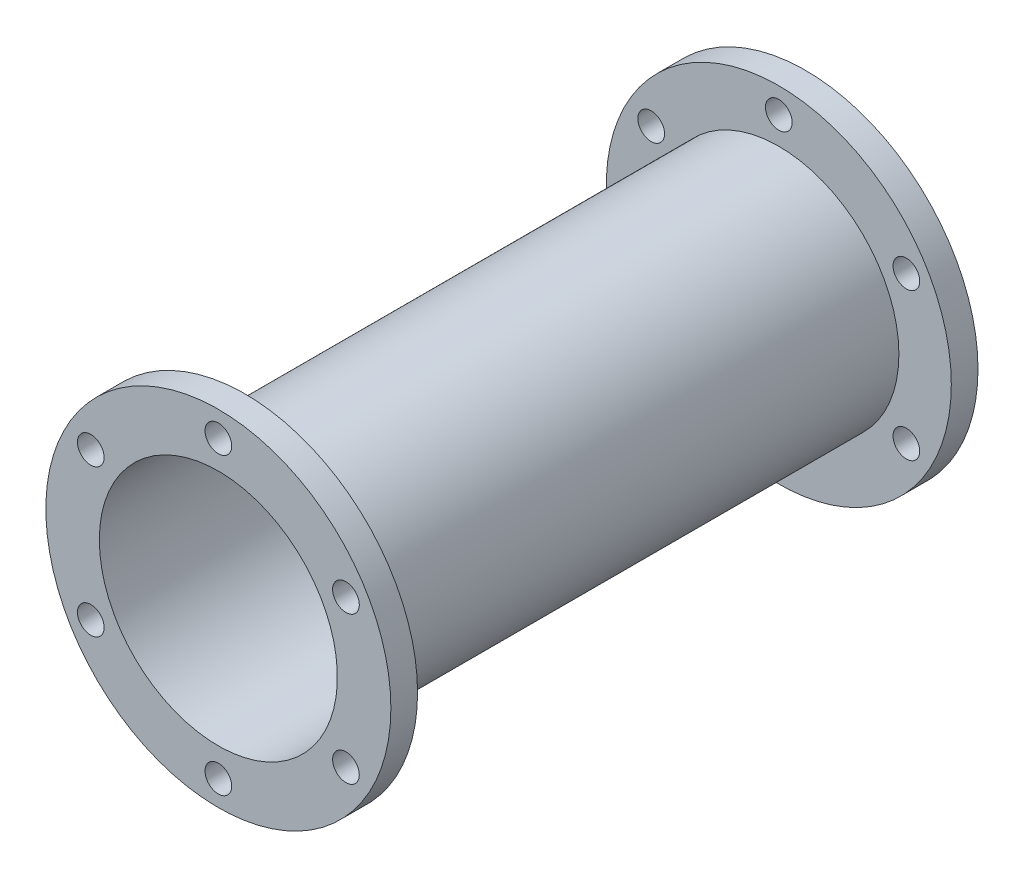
ISO-10303-21;
HEADER;
FILE_DESCRIPTION(('STEP AP214'),'2;1');
FILE_NAME('part.step','',(''),(''),'','','');
FILE_SCHEMA(('AUTOMOTIVE_DESIGN { 1 0 10303 214 1 1 1 1 }'));
ENDSEC;
DATA;
#1=APPLICATION_CONTEXT('core data for automotive mechanical design processes');
#2=APPLICATION_PROTOCOL_DEFINITION('international standard','automotive_design',2000,#1);
#3=PRODUCT_CONTEXT('',#1,'mechanical');
#4=PRODUCT('Part','Part','',(#3));
#5=PRODUCT_RELATED_PRODUCT_CATEGORY('part','',(#4));
#6=PRODUCT_DEFINITION_FORMATION('','',#4);
#7=PRODUCT_DEFINITION_CONTEXT('part definition',#1,'design');
#8=PRODUCT_DEFINITION('design','',#6,#7);
#9=PRODUCT_DEFINITION_SHAPE('','',#8);
#10=(LENGTH_UNIT() NAMED_UNIT(*) SI_UNIT(.MILLI.,.METRE.));
#11=(NAMED_UNIT(*) PLANE_ANGLE_UNIT() SI_UNIT($,.RADIAN.));
#12=(NAMED_UNIT(*) SI_UNIT($,.STERADIAN.) SOLID_ANGLE_UNIT());
#13=UNCERTAINTY_MEASURE_WITH_UNIT(LENGTH_MEASURE(1.E-05),#10,'distance_accuracy_value','');
#14=(GEOMETRIC_REPRESENTATION_CONTEXT(3) GLOBAL_UNCERTAINTY_ASSIGNED_CONTEXT((#13)) GLOBAL_UNIT_ASSIGNED_CONTEXT((#10,
#11,#12)) REPRESENTATION_CONTEXT('',''));
#15=CARTESIAN_POINT('',(0.,0.,0.));
#16=DIRECTION('',(0.,0.,1.));
#17=DIRECTION('',(1.,0.,0.));
#18=AXIS2_PLACEMENT_3D('',#15,#16,#17);
#19=CARTESIAN_POINT('',(0.,0.,6.35));
#20=DIRECTION('',(0.,0.,-1.));
#21=DIRECTION('',(-1.,0.,0.));
#22=AXIS2_PLACEMENT_3D('',#19,#20,#21);
#23=CYLINDRICAL_SURFACE('',#22,41.0464);
#24=CARTESIAN_POINT('',(0.,0.,6.35));
#25=DIRECTION('',(0.,0.,1.));
#26=DIRECTION('',(1.,0.,0.));
#27=AXIS2_PLACEMENT_3D('',#24,#25,#26);
#28=CIRCLE('',#27,41.0464);
#29=CARTESIAN_POINT('',(41.0464,0.,6.35));
#30=VERTEX_POINT('',#29);
#31=EDGE_CURVE('E10',#30,#30,#28,.T.);
#32=ORIENTED_EDGE('',*,*,#31,.F.);
#33=EDGE_LOOP('',(#32));
#34=FACE_BOUND('',#33,.T.);
#35=CARTESIAN_POINT('',(0.,0.,0.));
#36=DIRECTION('',(0.,0.,1.));
#37=DIRECTION('',(1.,0.,0.));
#38=AXIS2_PLACEMENT_3D('',#35,#36,#37);
#39=CIRCLE('',#38,41.0464);
#40=CARTESIAN_POINT('',(41.0464,0.,0.));
#41=VERTEX_POINT('',#40);
#42=EDGE_CURVE('E38',#41,#41,#39,.T.);
#43=ORIENTED_EDGE('',*,*,#42,.T.);
#44=EDGE_LOOP('',(#43));
#45=FACE_BOUND('',#44,.T.);
#46=ADVANCED_FACE('F35',(#34,#45),#23,.T.);
#47=CARTESIAN_POINT('',(0.,0.,6.35));
#48=DIRECTION('',(0.,0.,1.));
#49=DIRECTION('',(1.,0.,0.));
#50=AXIS2_PLACEMENT_3D('',#47,#48,#49);
#51=PLANE('',#50);
#52=CARTESIAN_POINT('',(0.,0.,6.35));
#53=DIRECTION('',(0.,0.,1.));
#54=DIRECTION('',(1.,0.,0.));
#55=AXIS2_PLACEMENT_3D('',#52,#53,#54);
#56=CIRCLE('',#55,28.575);
#57=CARTESIAN_POINT('',(28.575,0.,6.35));
#58=VERTEX_POINT('',#57);
#59=EDGE_CURVE('E83',#58,#58,#56,.T.);
#60=ORIENTED_EDGE('',*,*,#59,.F.);
#61=EDGE_LOOP('',(#60));
#62=FACE_BOUND('',#61,.T.);
#63=CARTESIAN_POINT('',(30.3559224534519,17.5260000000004,6.35));
#64=DIRECTION('',(0.,0.,1.));
#65=DIRECTION('',(0.50000000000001,-0.866025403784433,0.));
#66=AXIS2_PLACEMENT_3D('',#63,#64,#65);
#67=CIRCLE('',#66,3.175);
#68=CARTESIAN_POINT('',(31.943422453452,14.7763693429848,6.35));
#69=VERTEX_POINT('',#68);
#70=EDGE_CURVE('E59',#69,#69,#67,.T.);
#71=ORIENTED_EDGE('',*,*,#70,.F.);
#72=EDGE_LOOP('',(#71));
#73=FACE_BOUND('',#72,.T.);
#74=CARTESIAN_POINT('',(30.3559224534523,-17.5259999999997,6.35));
#75=DIRECTION('',(0.,0.,1.));
#76=DIRECTION('',(-0.499999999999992,-0.866025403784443,0.));
#77=AXIS2_PLACEMENT_3D('',#74,#75,#76);
#78=CIRCLE('',#77,3.175);
#79=CARTESIAN_POINT('',(28.7684224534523,-20.2756306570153,6.35));
#80=VERTEX_POINT('',#79);
#81=EDGE_CURVE('E66',#80,#80,#78,.T.);
#82=ORIENTED_EDGE('',*,*,#81,.F.);
#83=EDGE_LOOP('',(#82));
#84=FACE_BOUND('',#83,.T.);
#85=CARTESIAN_POINT('',(0.,-35.052,6.35));
#86=DIRECTION('',(0.,0.,1.));
#87=DIRECTION('',(-1.,0.,0.));
#88=AXIS2_PLACEMENT_3D('',#85,#86,#87);
#89=CIRCLE('',#88,3.175);
#90=CARTESIAN_POINT('',(-3.175,-35.052,6.35));
#91=VERTEX_POINT('',#90);
#92=EDGE_CURVE('E72',#91,#91,#89,.T.);
#93=ORIENTED_EDGE('',*,*,#92,.F.);
#94=EDGE_LOOP('',(#93));
#95=FACE_BOUND('',#94,.T.);
#96=CARTESIAN_POINT('',(-30.3559224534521,-17.5260000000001,6.35));
#97=DIRECTION('',(0.,0.,1.));
#98=DIRECTION('',(-0.500000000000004,0.866025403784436,0.));
#99=AXIS2_PLACEMENT_3D('',#96,#97,#98);
#100=CIRCLE('',#99,3.175);
#101=CARTESIAN_POINT('',(-31.9434224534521,-14.7763693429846,6.35));
#102=VERTEX_POINT('',#101);
#103=EDGE_CURVE('E78',#102,#102,#100,.T.);
#104=ORIENTED_EDGE('',*,*,#103,.F.);
#105=EDGE_LOOP('',(#104));
#106=FACE_BOUND('',#105,.T.);
#107=CARTESIAN_POINT('',(-30.3559224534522,17.5259999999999,6.35));
#108=DIRECTION('',(0.,0.,1.));
#109=DIRECTION('',(0.499999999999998,0.86602540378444,0.));
#110=AXIS2_PLACEMENT_3D('',#107,#108,#109);
#111=CIRCLE('',#110,3.175);
#112=CARTESIAN_POINT('',(-28.7684224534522,20.2756306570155,6.35));
#113=VERTEX_POINT('',#112);
#114=EDGE_CURVE('E53',#113,#113,#111,.T.);
#115=ORIENTED_EDGE('',*,*,#114,.F.);
#116=EDGE_LOOP('',(#115));
#117=FACE_BOUND('',#116,.T.);
#118=CARTESIAN_POINT('',(0.,35.052,6.35));
#119=DIRECTION('',(0.,0.,1.));
#120=DIRECTION('',(1.,0.,0.));
#121=AXIS2_PLACEMENT_3D('',#118,#119,#120);
#122=CIRCLE('',#121,3.175);
#123=CARTESIAN_POINT('',(3.175,35.052,6.35));
#124=VERTEX_POINT('',#123);
#125=EDGE_CURVE('E47',#124,#124,#122,.T.);
#126=ORIENTED_EDGE('',*,*,#125,.F.);
#127=EDGE_LOOP('',(#126));
#128=FACE_BOUND('',#127,.T.);
#129=ORIENTED_EDGE('',*,*,#31,.T.);
#130=EDGE_LOOP('',(#129));
#131=FACE_BOUND('',#130,.T.);
#132=ADVANCED_FACE('F180',(#62,#73,#84,#95,#106,#117,#128,#131),#51,.T.);
#133=CARTESIAN_POINT('',(0.,0.,0.));
#134=DIRECTION('',(0.,0.,1.));
#135=DIRECTION('',(1.,0.,0.));
#136=AXIS2_PLACEMENT_3D('',#133,#134,#135);
#137=PLANE('',#136);
#138=CARTESIAN_POINT('',(0.,0.,0.));
#139=DIRECTION('',(0.,0.,-1.));
#140=DIRECTION('',(-1.,0.,0.));
#141=AXIS2_PLACEMENT_3D('',#138,#139,#140);
#142=CIRCLE('',#141,28.321);
#143=CARTESIAN_POINT('',(-28.321,0.,0.));
#144=VERTEX_POINT('',#143);
#145=EDGE_CURVE('E95',#144,#144,#142,.T.);
#146=ORIENTED_EDGE('',*,*,#145,.F.);
#147=EDGE_LOOP('',(#146));
#148=FACE_BOUND('',#147,.T.);
#149=CARTESIAN_POINT('',(30.3559224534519,17.5260000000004,0.));
#150=DIRECTION('',(0.,0.,1.));
#151=DIRECTION('',(0.50000000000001,-0.866025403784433,0.));
#152=AXIS2_PLACEMENT_3D('',#149,#150,#151);
#153=CIRCLE('',#152,3.175);
#154=CARTESIAN_POINT('',(31.943422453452,14.7763693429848,0.));
#155=VERTEX_POINT('',#154);
#156=EDGE_CURVE('E62',#155,#155,#153,.T.);
#157=ORIENTED_EDGE('',*,*,#156,.T.);
#158=EDGE_LOOP('',(#157));
#159=FACE_BOUND('',#158,.T.);
#160=CARTESIAN_POINT('',(30.3559224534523,-17.5259999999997,0.));
#161=DIRECTION('',(0.,0.,1.));
#162=DIRECTION('',(-0.499999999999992,-0.866025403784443,0.));
#163=AXIS2_PLACEMENT_3D('',#160,#161,#162);
#164=CIRCLE('',#163,3.175);
#165=CARTESIAN_POINT('',(28.7684224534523,-20.2756306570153,0.));
#166=VERTEX_POINT('',#165);
#167=EDGE_CURVE('E69',#166,#166,#164,.T.);
#168=ORIENTED_EDGE('',*,*,#167,.T.);
#169=EDGE_LOOP('',(#168));
#170=FACE_BOUND('',#169,.T.);
#171=CARTESIAN_POINT('',(0.,-35.052,0.));
#172=DIRECTION('',(0.,0.,1.));
#173=DIRECTION('',(-1.,0.,0.));
#174=AXIS2_PLACEMENT_3D('',#171,#172,#173);
#175=CIRCLE('',#174,3.175);
#176=CARTESIAN_POINT('',(-3.175,-35.052,0.));
#177=VERTEX_POINT('',#176);
#178=EDGE_CURVE('E75',#177,#177,#175,.T.);
#179=ORIENTED_EDGE('',*,*,#178,.T.);
#180=EDGE_LOOP('',(#179));
#181=FACE_BOUND('',#180,.T.);
#182=CARTESIAN_POINT('',(-30.3559224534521,-17.5260000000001,0.));
#183=DIRECTION('',(0.,0.,1.));
#184=DIRECTION('',(-0.500000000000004,0.866025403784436,0.));
#185=AXIS2_PLACEMENT_3D('',#182,#183,#184);
#186=CIRCLE('',#185,3.175);
#187=CARTESIAN_POINT('',(-31.9434224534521,-14.7763693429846,0.));
#188=VERTEX_POINT('',#187);
#189=EDGE_CURVE('E56',#188,#188,#186,.T.);
#190=ORIENTED_EDGE('',*,*,#189,.T.);
#191=EDGE_LOOP('',(#190));
#192=FACE_BOUND('',#191,.T.);
#193=CARTESIAN_POINT('',(-30.3559224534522,17.5259999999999,0.));
#194=DIRECTION('',(0.,0.,1.));
#195=DIRECTION('',(0.499999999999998,0.86602540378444,0.));
#196=AXIS2_PLACEMENT_3D('',#193,#194,#195);
#197=CIRCLE('',#196,3.175);
#198=CARTESIAN_POINT('',(-28.7684224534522,20.2756306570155,0.));
#199=VERTEX_POINT('',#198);
#200=EDGE_CURVE('E50',#199,#199,#197,.T.);
#201=ORIENTED_EDGE('',*,*,#200,.T.);
#202=EDGE_LOOP('',(#201));
#203=FACE_BOUND('',#202,.T.);
#204=CARTESIAN_POINT('',(0.,35.052,0.));
#205=DIRECTION('',(0.,0.,1.));
#206=DIRECTION('',(1.,0.,0.));
#207=AXIS2_PLACEMENT_3D('',#204,#205,#206);
#208=CIRCLE('',#207,3.175);
#209=CARTESIAN_POINT('',(3.175,35.052,0.));
#210=VERTEX_POINT('',#209);
#211=EDGE_CURVE('E45',#210,#210,#208,.T.);
#212=ORIENTED_EDGE('',*,*,#211,.T.);
#213=EDGE_LOOP('',(#212));
#214=FACE_BOUND('',#213,.T.);
#215=ORIENTED_EDGE('',*,*,#42,.F.);
#216=EDGE_LOOP('',(#215));
#217=FACE_BOUND('',#216,.T.);
#218=ADVANCED_FACE('F185',(#148,#159,#170,#181,#192,#203,#214,#217),#137,.F.);
#219=CARTESIAN_POINT('',(0.,35.052,0.));
#220=DIRECTION('',(0.,0.,1.));
#221=DIRECTION('',(1.,0.,0.));
#222=AXIS2_PLACEMENT_3D('',#219,#220,#221);
#223=CYLINDRICAL_SURFACE('',#222,3.175);
#224=ORIENTED_EDGE('',*,*,#211,.F.);
#225=EDGE_LOOP('',(#224));
#226=FACE_BOUND('',#225,.T.);
#227=ORIENTED_EDGE('',*,*,#125,.T.);
#228=EDGE_LOOP('',(#227));
#229=FACE_BOUND('',#228,.T.);
#230=ADVANCED_FACE('F192',(#226,#229),#223,.F.);
#231=CARTESIAN_POINT('',(-30.3559224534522,17.5259999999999,0.));
#232=DIRECTION('',(0.,0.,1.));
#233=DIRECTION('',(1.,0.,0.));
#234=AXIS2_PLACEMENT_3D('',#231,#232,#233);
#235=CYLINDRICAL_SURFACE('',#234,3.175);
#236=ORIENTED_EDGE('',*,*,#200,.F.);
#237=EDGE_LOOP('',(#236));
#238=FACE_BOUND('',#237,.T.);
#239=ORIENTED_EDGE('',*,*,#114,.T.);
#240=EDGE_LOOP('',(#239));
#241=FACE_BOUND('',#240,.T.);
#242=ADVANCED_FACE('F197',(#238,#241),#235,.F.);
#243=CARTESIAN_POINT('',(-30.3559224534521,-17.5260000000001,0.));
#244=DIRECTION('',(0.,0.,1.));
#245=DIRECTION('',(1.,0.,0.));
#246=AXIS2_PLACEMENT_3D('',#243,#244,#245);
#247=CYLINDRICAL_SURFACE('',#246,3.175);
#248=ORIENTED_EDGE('',*,*,#189,.F.);
#249=EDGE_LOOP('',(#248));
#250=FACE_BOUND('',#249,.T.);
#251=ORIENTED_EDGE('',*,*,#103,.T.);
#252=EDGE_LOOP('',(#251));
#253=FACE_BOUND('',#252,.T.);
#254=ADVANCED_FACE('F205',(#250,#253),#247,.F.);
#255=CARTESIAN_POINT('',(0.,-35.052,0.));
#256=DIRECTION('',(0.,0.,1.));
#257=DIRECTION('',(1.,0.,0.));
#258=AXIS2_PLACEMENT_3D('',#255,#256,#257);
#259=CYLINDRICAL_SURFACE('',#258,3.175);
#260=ORIENTED_EDGE('',*,*,#178,.F.);
#261=EDGE_LOOP('',(#260));
#262=FACE_BOUND('',#261,.T.);
#263=ORIENTED_EDGE('',*,*,#92,.T.);
#264=EDGE_LOOP('',(#263));
#265=FACE_BOUND('',#264,.T.);
#266=ADVANCED_FACE('F214',(#262,#265),#259,.F.);
#267=CARTESIAN_POINT('',(30.3559224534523,-17.5259999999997,0.));
#268=DIRECTION('',(0.,0.,1.));
#269=DIRECTION('',(1.,0.,0.));
#270=AXIS2_PLACEMENT_3D('',#267,#268,#269);
#271=CYLINDRICAL_SURFACE('',#270,3.175);
#272=ORIENTED_EDGE('',*,*,#167,.F.);
#273=EDGE_LOOP('',(#272));
#274=FACE_BOUND('',#273,.T.);
#275=ORIENTED_EDGE('',*,*,#81,.T.);
#276=EDGE_LOOP('',(#275));
#277=FACE_BOUND('',#276,.T.);
#278=ADVANCED_FACE('F210',(#274,#277),#271,.F.);
#279=CARTESIAN_POINT('',(30.3559224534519,17.5260000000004,0.));
#280=DIRECTION('',(0.,0.,1.));
#281=DIRECTION('',(1.,0.,0.));
#282=AXIS2_PLACEMENT_3D('',#279,#280,#281);
#283=CYLINDRICAL_SURFACE('',#282,3.175);
#284=ORIENTED_EDGE('',*,*,#156,.F.);
#285=EDGE_LOOP('',(#284));
#286=FACE_BOUND('',#285,.T.);
#287=ORIENTED_EDGE('',*,*,#70,.T.);
#288=EDGE_LOOP('',(#287));
#289=FACE_BOUND('',#288,.T.);
#290=ADVANCED_FACE('F207',(#286,#289),#283,.F.);
#291=CARTESIAN_POINT('',(0.,0.,133.35));
#292=DIRECTION('',(0.,0.,-1.));
#293=DIRECTION('',(-1.,0.,0.));
#294=AXIS2_PLACEMENT_3D('',#291,#292,#293);
#295=CYLINDRICAL_SURFACE('',#294,28.575);
#296=CARTESIAN_POINT('',(0.,0.,133.35));
#297=DIRECTION('',(0.,0.,1.));
#298=DIRECTION('',(1.,0.,0.));
#299=AXIS2_PLACEMENT_3D('',#296,#297,#298);
#300=CIRCLE('',#299,28.575);
#301=CARTESIAN_POINT('',(28.575,0.,133.35));
#302=VERTEX_POINT('',#301);
#303=EDGE_CURVE('E63',#302,#302,#300,.T.);
#304=ORIENTED_EDGE('',*,*,#303,.F.);
#305=EDGE_LOOP('',(#304));
#306=FACE_BOUND('',#305,.T.);
#307=ORIENTED_EDGE('',*,*,#59,.T.);
#308=EDGE_LOOP('',(#307));
#309=FACE_BOUND('',#308,.T.);
#310=ADVANCED_FACE('F164',(#306,#309),#295,.T.);
#311=CARTESIAN_POINT('',(0.,0.,139.7));
#312=DIRECTION('',(0.,0.,-1.));
#313=DIRECTION('',(-1.,0.,0.));
#314=AXIS2_PLACEMENT_3D('',#311,#312,#313);
#315=CYLINDRICAL_SURFACE('',#314,41.0464);
#316=CARTESIAN_POINT('',(0.,0.,139.7));
#317=DIRECTION('',(0.,0.,1.));
#318=DIRECTION('',(1.,0.,0.));
#319=AXIS2_PLACEMENT_3D('',#316,#317,#318);
#320=CIRCLE('',#319,41.0464);
#321=CARTESIAN_POINT('',(41.0464,0.,139.7));
#322=VERTEX_POINT('',#321);
#323=EDGE_CURVE('E86',#322,#322,#320,.T.);
#324=ORIENTED_EDGE('',*,*,#323,.F.);
#325=EDGE_LOOP('',(#324));
#326=FACE_BOUND('',#325,.T.);
#327=CARTESIAN_POINT('',(0.,0.,133.35));
#328=DIRECTION('',(0.,0.,1.));
#329=DIRECTION('',(1.,0.,0.));
#330=AXIS2_PLACEMENT_3D('',#327,#328,#329);
#331=CIRCLE('',#330,41.0464);
#332=CARTESIAN_POINT('',(41.0464,0.,133.35));
#333=VERTEX_POINT('',#332);
#334=EDGE_CURVE('E89',#333,#333,#331,.T.);
#335=ORIENTED_EDGE('',*,*,#334,.T.);
#336=EDGE_LOOP('',(#335));
#337=FACE_BOUND('',#336,.T.);
#338=ADVANCED_FACE('F151',(#326,#337),#315,.T.);
#339=CARTESIAN_POINT('',(0.,0.,139.7));
#340=DIRECTION('',(0.,0.,1.));
#341=DIRECTION('',(1.,0.,0.));
#342=AXIS2_PLACEMENT_3D('',#339,#340,#341);
#343=PLANE('',#342);
#344=CARTESIAN_POINT('',(30.3559224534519,17.5260000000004,139.7));
#345=DIRECTION('',(0.,0.,1.));
#346=DIRECTION('',(0.50000000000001,-0.866025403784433,0.));
#347=AXIS2_PLACEMENT_3D('',#344,#345,#346);
#348=CIRCLE('',#347,3.17499999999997);
#349=CARTESIAN_POINT('',(31.9434224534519,14.7763693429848,139.7));
#350=VERTEX_POINT('',#349);
#351=EDGE_CURVE('E113',#350,#350,#348,.T.);
#352=ORIENTED_EDGE('',*,*,#351,.F.);
#353=EDGE_LOOP('',(#352));
#354=FACE_BOUND('',#353,.T.);
#355=CARTESIAN_POINT('',(30.3559224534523,-17.5259999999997,139.7));
#356=DIRECTION('',(0.,0.,1.));
#357=DIRECTION('',(-0.499999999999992,-0.866025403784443,0.));
#358=AXIS2_PLACEMENT_3D('',#355,#356,#357);
#359=CIRCLE('',#358,3.17499999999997);
#360=CARTESIAN_POINT('',(28.7684224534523,-20.2756306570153,139.7));
#361=VERTEX_POINT('',#360);
#362=EDGE_CURVE('E119',#361,#361,#359,.T.);
#363=ORIENTED_EDGE('',*,*,#362,.F.);
#364=EDGE_LOOP('',(#363));
#365=FACE_BOUND('',#364,.T.);
#366=CARTESIAN_POINT('',(0.,-35.052,139.7));
#367=DIRECTION('',(0.,0.,1.));
#368=DIRECTION('',(-1.,0.,0.));
#369=AXIS2_PLACEMENT_3D('',#366,#367,#368);
#370=CIRCLE('',#369,3.17499999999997);
#371=CARTESIAN_POINT('',(-3.17499999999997,-35.052,139.7));
#372=VERTEX_POINT('',#371);
#373=EDGE_CURVE('E125',#372,#372,#370,.T.);
#374=ORIENTED_EDGE('',*,*,#373,.F.);
#375=EDGE_LOOP('',(#374));
#376=FACE_BOUND('',#375,.T.);
#377=CARTESIAN_POINT('',(-30.3559224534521,-17.5260000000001,139.7));
#378=DIRECTION('',(0.,0.,1.));
#379=DIRECTION('',(-0.500000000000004,0.866025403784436,0.));
#380=AXIS2_PLACEMENT_3D('',#377,#378,#379);
#381=CIRCLE('',#380,3.17499999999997);
#382=CARTESIAN_POINT('',(-31.9434224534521,-14.7763693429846,139.7));
#383=VERTEX_POINT('',#382);
#384=EDGE_CURVE('E131',#383,#383,#381,.T.);
#385=ORIENTED_EDGE('',*,*,#384,.F.);
#386=EDGE_LOOP('',(#385));
#387=FACE_BOUND('',#386,.T.);
#388=CARTESIAN_POINT('',(-30.3559224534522,17.5259999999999,139.7));
#389=DIRECTION('',(0.,0.,1.));
#390=DIRECTION('',(0.499999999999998,0.86602540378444,0.));
#391=AXIS2_PLACEMENT_3D('',#388,#389,#390);
#392=CIRCLE('',#391,3.17499999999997);
#393=CARTESIAN_POINT('',(-28.7684224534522,20.2756306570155,139.7));
#394=VERTEX_POINT('',#393);
#395=EDGE_CURVE('E107',#394,#394,#392,.T.);
#396=ORIENTED_EDGE('',*,*,#395,.F.);
#397=EDGE_LOOP('',(#396));
#398=FACE_BOUND('',#397,.T.);
#399=CARTESIAN_POINT('',(0.,35.052,139.7));
#400=DIRECTION('',(0.,0.,1.));
#401=DIRECTION('',(1.,0.,0.));
#402=AXIS2_PLACEMENT_3D('',#399,#400,#401);
#403=CIRCLE('',#402,3.17499999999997);
#404=CARTESIAN_POINT('',(3.17499999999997,35.052,139.7));
#405=VERTEX_POINT('',#404);
#406=EDGE_CURVE('E101',#405,#405,#403,.T.);
#407=ORIENTED_EDGE('',*,*,#406,.F.);
#408=EDGE_LOOP('',(#407));
#409=FACE_BOUND('',#408,.T.);
#410=CARTESIAN_POINT('',(0.,0.,139.7));
#411=DIRECTION('',(0.,0.,-1.));
#412=DIRECTION('',(-1.,0.,0.));
#413=AXIS2_PLACEMENT_3D('',#410,#411,#412);
#414=CIRCLE('',#413,28.321);
#415=CARTESIAN_POINT('',(-28.321,0.,139.7));
#416=VERTEX_POINT('',#415);
#417=EDGE_CURVE('E92',#416,#416,#414,.T.);
#418=ORIENTED_EDGE('',*,*,#417,.T.);
#419=EDGE_LOOP('',(#418));
#420=FACE_BOUND('',#419,.T.);
#421=ORIENTED_EDGE('',*,*,#323,.T.);
#422=EDGE_LOOP('',(#421));
#423=FACE_BOUND('',#422,.T.);
#424=ADVANCED_FACE('F148',(#354,#365,#376,#387,#398,#409,#420,#423),#343,.T.);
#425=CARTESIAN_POINT('',(0.,0.,133.35));
#426=DIRECTION('',(0.,0.,1.));
#427=DIRECTION('',(1.,0.,0.));
#428=AXIS2_PLACEMENT_3D('',#425,#426,#427);
#429=PLANE('',#428);
#430=CARTESIAN_POINT('',(30.3559224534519,17.5260000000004,133.35));
#431=DIRECTION('',(0.,0.,1.));
#432=DIRECTION('',(0.50000000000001,-0.866025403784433,0.));
#433=AXIS2_PLACEMENT_3D('',#430,#431,#432);
#434=CIRCLE('',#433,3.17499999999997);
#435=CARTESIAN_POINT('',(31.9434224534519,14.7763693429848,133.35));
#436=VERTEX_POINT('',#435);
#437=EDGE_CURVE('E116',#436,#436,#434,.T.);
#438=ORIENTED_EDGE('',*,*,#437,.T.);
#439=EDGE_LOOP('',(#438));
#440=FACE_BOUND('',#439,.T.);
#441=CARTESIAN_POINT('',(30.3559224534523,-17.5259999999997,133.35));
#442=DIRECTION('',(0.,0.,1.));
#443=DIRECTION('',(-0.499999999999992,-0.866025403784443,0.));
#444=AXIS2_PLACEMENT_3D('',#441,#442,#443);
#445=CIRCLE('',#444,3.17499999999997);
#446=CARTESIAN_POINT('',(28.7684224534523,-20.2756306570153,133.35));
#447=VERTEX_POINT('',#446);
#448=EDGE_CURVE('E122',#447,#447,#445,.T.);
#449=ORIENTED_EDGE('',*,*,#448,.T.);
#450=EDGE_LOOP('',(#449));
#451=FACE_BOUND('',#450,.T.);
#452=CARTESIAN_POINT('',(0.,-35.052,133.35));
#453=DIRECTION('',(0.,0.,1.));
#454=DIRECTION('',(-1.,0.,0.));
#455=AXIS2_PLACEMENT_3D('',#452,#453,#454);
#456=CIRCLE('',#455,3.17499999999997);
#457=CARTESIAN_POINT('',(-3.17499999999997,-35.052,133.35));
#458=VERTEX_POINT('',#457);
#459=EDGE_CURVE('E128',#458,#458,#456,.T.);
#460=ORIENTED_EDGE('',*,*,#459,.T.);
#461=EDGE_LOOP('',(#460));
#462=FACE_BOUND('',#461,.T.);
#463=CARTESIAN_POINT('',(-30.3559224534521,-17.5260000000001,133.35));
#464=DIRECTION('',(0.,0.,1.));
#465=DIRECTION('',(-0.500000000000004,0.866025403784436,0.));
#466=AXIS2_PLACEMENT_3D('',#463,#464,#465);
#467=CIRCLE('',#466,3.17499999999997);
#468=CARTESIAN_POINT('',(-31.9434224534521,-14.7763693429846,133.35));
#469=VERTEX_POINT('',#468);
#470=EDGE_CURVE('E110',#469,#469,#467,.T.);
#471=ORIENTED_EDGE('',*,*,#470,.T.);
#472=EDGE_LOOP('',(#471));
#473=FACE_BOUND('',#472,.T.);
#474=CARTESIAN_POINT('',(-30.3559224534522,17.5259999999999,133.35));
#475=DIRECTION('',(0.,0.,1.));
#476=DIRECTION('',(0.499999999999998,0.86602540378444,0.));
#477=AXIS2_PLACEMENT_3D('',#474,#475,#476);
#478=CIRCLE('',#477,3.17499999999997);
#479=CARTESIAN_POINT('',(-28.7684224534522,20.2756306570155,133.35));
#480=VERTEX_POINT('',#479);
#481=EDGE_CURVE('E104',#480,#480,#478,.T.);
#482=ORIENTED_EDGE('',*,*,#481,.T.);
#483=EDGE_LOOP('',(#482));
#484=FACE_BOUND('',#483,.T.);
#485=CARTESIAN_POINT('',(0.,35.052,133.35));
#486=DIRECTION('',(0.,0.,1.));
#487=DIRECTION('',(1.,0.,0.));
#488=AXIS2_PLACEMENT_3D('',#485,#486,#487);
#489=CIRCLE('',#488,3.17499999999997);
#490=CARTESIAN_POINT('',(3.17499999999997,35.052,133.35));
#491=VERTEX_POINT('',#490);
#492=EDGE_CURVE('E98',#491,#491,#489,.T.);
#493=ORIENTED_EDGE('',*,*,#492,.T.);
#494=EDGE_LOOP('',(#493));
#495=FACE_BOUND('',#494,.T.);
#496=ORIENTED_EDGE('',*,*,#303,.T.);
#497=EDGE_LOOP('',(#496));
#498=FACE_BOUND('',#497,.T.);
#499=ORIENTED_EDGE('',*,*,#334,.F.);
#500=EDGE_LOOP('',(#499));
#501=FACE_BOUND('',#500,.T.);
#502=ADVANCED_FACE('F137',(#440,#451,#462,#473,#484,#495,#498,#501),#429,.F.);
#503=CARTESIAN_POINT('',(0.,0.,139.7));
#504=DIRECTION('',(0.,0.,-1.));
#505=DIRECTION('',(-1.,0.,0.));
#506=AXIS2_PLACEMENT_3D('',#503,#504,#505);
#507=CYLINDRICAL_SURFACE('',#506,28.321);
#508=ORIENTED_EDGE('',*,*,#417,.F.);
#509=EDGE_LOOP('',(#508));
#510=FACE_BOUND('',#509,.T.);
#511=ORIENTED_EDGE('',*,*,#145,.T.);
#512=EDGE_LOOP('',(#511));
#513=FACE_BOUND('',#512,.T.);
#514=ADVANCED_FACE('F169',(#510,#513),#507,.F.);
#515=CARTESIAN_POINT('',(0.,35.052,133.35));
#516=DIRECTION('',(0.,0.,1.));
#517=DIRECTION('',(1.,0.,0.));
#518=AXIS2_PLACEMENT_3D('',#515,#516,#517);
#519=CYLINDRICAL_SURFACE('',#518,3.17499999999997);
#520=ORIENTED_EDGE('',*,*,#492,.F.);
#521=EDGE_LOOP('',(#520));
#522=FACE_BOUND('',#521,.T.);
#523=ORIENTED_EDGE('',*,*,#406,.T.);
#524=EDGE_LOOP('',(#523));
#525=FACE_BOUND('',#524,.T.);
#526=ADVANCED_FACE('F175',(#522,#525),#519,.F.);
#527=CARTESIAN_POINT('',(-30.3559224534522,17.5259999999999,133.35));
#528=DIRECTION('',(0.,0.,1.));
#529=DIRECTION('',(1.,0.,0.));
#530=AXIS2_PLACEMENT_3D('',#527,#528,#529);
#531=CYLINDRICAL_SURFACE('',#530,3.17499999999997);
#532=ORIENTED_EDGE('',*,*,#481,.F.);
#533=EDGE_LOOP('',(#532));
#534=FACE_BOUND('',#533,.T.);
#535=ORIENTED_EDGE('',*,*,#395,.T.);
#536=EDGE_LOOP('',(#535));
#537=FACE_BOUND('',#536,.T.);
#538=ADVANCED_FACE('F144',(#534,#537),#531,.F.);
#539=CARTESIAN_POINT('',(-30.3559224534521,-17.5260000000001,133.35));
#540=DIRECTION('',(0.,0.,1.));
#541=DIRECTION('',(1.,0.,0.));
#542=AXIS2_PLACEMENT_3D('',#539,#540,#541);
#543=CYLINDRICAL_SURFACE('',#542,3.17499999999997);
#544=ORIENTED_EDGE('',*,*,#470,.F.);
#545=EDGE_LOOP('',(#544));
#546=FACE_BOUND('',#545,.T.);
#547=ORIENTED_EDGE('',*,*,#384,.T.);
#548=EDGE_LOOP('',(#547));
#549=FACE_BOUND('',#548,.T.);
#550=ADVANCED_FACE('F140',(#546,#549),#543,.F.);
#551=CARTESIAN_POINT('',(0.,-35.052,133.35));
#552=DIRECTION('',(0.,0.,1.));
#553=DIRECTION('',(1.,0.,0.));
#554=AXIS2_PLACEMENT_3D('',#551,#552,#553);
#555=CYLINDRICAL_SURFACE('',#554,3.17499999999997);
#556=ORIENTED_EDGE('',*,*,#459,.F.);
#557=EDGE_LOOP('',(#556));
#558=FACE_BOUND('',#557,.T.);
#559=ORIENTED_EDGE('',*,*,#373,.T.);
#560=EDGE_LOOP('',(#559));
#561=FACE_BOUND('',#560,.T.);
#562=ADVANCED_FACE('F143',(#558,#561),#555,.F.);
#563=CARTESIAN_POINT('',(30.3559224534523,-17.5259999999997,133.35));
#564=DIRECTION('',(0.,0.,1.));
#565=DIRECTION('',(1.,0.,0.));
#566=AXIS2_PLACEMENT_3D('',#563,#564,#565);
#567=CYLINDRICAL_SURFACE('',#566,3.17499999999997);
#568=ORIENTED_EDGE('',*,*,#448,.F.);
#569=EDGE_LOOP('',(#568));
#570=FACE_BOUND('',#569,.T.);
#571=ORIENTED_EDGE('',*,*,#362,.T.);
#572=EDGE_LOOP('',(#571));
#573=FACE_BOUND('',#572,.T.);
#574=ADVANCED_FACE('F293',(#570,#573),#567,.F.);
#575=CARTESIAN_POINT('',(30.3559224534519,17.5260000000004,133.35));
#576=DIRECTION('',(0.,0.,1.));
#577=DIRECTION('',(1.,0.,0.));
#578=AXIS2_PLACEMENT_3D('',#575,#576,#577);
#579=CYLINDRICAL_SURFACE('',#578,3.17499999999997);
#580=ORIENTED_EDGE('',*,*,#437,.F.);
#581=EDGE_LOOP('',(#580));
#582=FACE_BOUND('',#581,.T.);
#583=ORIENTED_EDGE('',*,*,#351,.T.);
#584=EDGE_LOOP('',(#583));
#585=FACE_BOUND('',#584,.T.);
#586=ADVANCED_FACE('F303',(#582,#585),#579,.F.);
#587=CLOSED_SHELL('',(#46,#132,#218,#230,#242,#254,#266,#278,#290,#310,#338,#424,#502,#514,#526,
#538,#550,#562,#574,#586));
#588=MANIFOLD_SOLID_BREP('B2',#587);
#589=ADVANCED_BREP_SHAPE_REPRESENTATION('',(#18,#588),#14);
#590=SHAPE_DEFINITION_REPRESENTATION(#9,#589);
ENDSEC;
END-ISO-10303-21;
